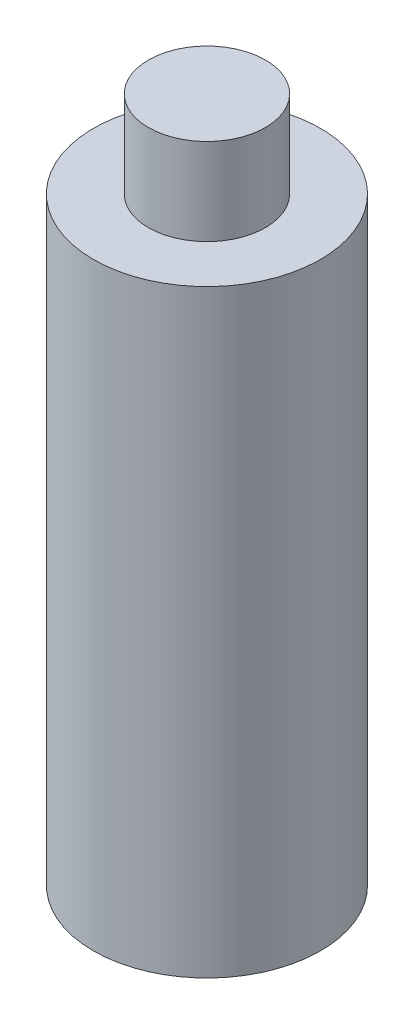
ISO-10303-21;
HEADER;
FILE_DESCRIPTION(('STEP AP214'),'2;1');
FILE_NAME('part.step','',(''),(''),'','','');
FILE_SCHEMA(('AUTOMOTIVE_DESIGN { 1 0 10303 214 1 1 1 1 }'));
ENDSEC;
DATA;
#1=APPLICATION_CONTEXT('core data for automotive mechanical design processes');
#2=APPLICATION_PROTOCOL_DEFINITION('international standard','automotive_design',2000,#1);
#3=PRODUCT_CONTEXT('',#1,'mechanical');
#4=PRODUCT('Part','Part','',(#3));
#5=PRODUCT_RELATED_PRODUCT_CATEGORY('part','',(#4));
#6=PRODUCT_DEFINITION_FORMATION('','',#4);
#7=PRODUCT_DEFINITION_CONTEXT('part definition',#1,'design');
#8=PRODUCT_DEFINITION('design','',#6,#7);
#9=PRODUCT_DEFINITION_SHAPE('','',#8);
#10=(LENGTH_UNIT() NAMED_UNIT(*) SI_UNIT(.MILLI.,.METRE.));
#11=(NAMED_UNIT(*) PLANE_ANGLE_UNIT() SI_UNIT($,.RADIAN.));
#12=(NAMED_UNIT(*) SI_UNIT($,.STERADIAN.) SOLID_ANGLE_UNIT());
#13=UNCERTAINTY_MEASURE_WITH_UNIT(LENGTH_MEASURE(1.E-05),#10,'distance_accuracy_value','');
#14=(GEOMETRIC_REPRESENTATION_CONTEXT(3) GLOBAL_UNCERTAINTY_ASSIGNED_CONTEXT((#13)) GLOBAL_UNIT_ASSIGNED_CONTEXT((#10,
#11,#12)) REPRESENTATION_CONTEXT('',''));
#15=CARTESIAN_POINT('',(0.,0.,0.));
#16=DIRECTION('',(0.,0.,1.));
#17=DIRECTION('',(1.,0.,0.));
#18=AXIS2_PLACEMENT_3D('',#15,#16,#17);
#19=CARTESIAN_POINT('',(0.,-3.75919999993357,0.));
#20=DIRECTION('',(0.,-1.,0.));
#21=DIRECTION('',(1.,0.,0.));
#22=AXIS2_PLACEMENT_3D('',#19,#20,#21);
#23=CONICAL_SURFACE('',#22,1.60019999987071,0.89993886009);
#24=CARTESIAN_POINT('',(0.,-2.4891999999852,-8.5265128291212E-11));
#25=VERTEX_POINT('',#24);
#26=VERTEX_LOOP('',#25);
#27=FACE_BOUND('',#26,.T.);
#28=CARTESIAN_POINT('',(0.,-3.7592,0.));
#29=DIRECTION('',(0.,1.,0.));
#30=DIRECTION('',(0.,0.,1.));
#31=AXIS2_PLACEMENT_3D('',#28,#29,#30);
#32=CIRCLE('',#31,1.6002);
#33=CARTESIAN_POINT('',(0.,-3.7592,1.6002));
#34=VERTEX_POINT('',#33);
#35=EDGE_CURVE('E33',#34,#34,#32,.F.);
#36=ORIENTED_EDGE('',*,*,#35,.T.);
#37=EDGE_LOOP('',(#36));
#38=FACE_BOUND('',#37,.T.);
#39=ADVANCED_FACE('F17',(#27,#38),#23,.F.);
#40=CARTESIAN_POINT('',(0.,0.,0.));
#41=DIRECTION('',(0.,1.,0.));
#42=DIRECTION('',(0.,0.,1.));
#43=AXIS2_PLACEMENT_3D('',#40,#41,#42);
#44=PLANE('',#43);
#45=CARTESIAN_POINT('',(0.,0.,0.));
#46=DIRECTION('',(0.,1.,0.));
#47=DIRECTION('',(0.,0.,1.));
#48=AXIS2_PLACEMENT_3D('',#45,#46,#47);
#49=CIRCLE('',#48,1.0795);
#50=CARTESIAN_POINT('',(0.,0.,1.0795));
#51=VERTEX_POINT('',#50);
#52=EDGE_CURVE('E20',#51,#51,#49,.F.);
#53=ORIENTED_EDGE('',*,*,#52,.F.);
#54=EDGE_LOOP('',(#53));
#55=FACE_BOUND('',#54,.T.);
#56=ADVANCED_FACE('F30',(#55),#44,.T.);
#57=CARTESIAN_POINT('',(0.,-12.6492,0.));
#58=DIRECTION('',(0.,1.,0.));
#59=DIRECTION('',(0.,0.,1.));
#60=AXIS2_PLACEMENT_3D('',#57,#58,#59);
#61=CYLINDRICAL_SURFACE('',#60,1.6002);
#62=CARTESIAN_POINT('',(0.,-12.6492,0.));
#63=DIRECTION('',(0.,1.,0.));
#64=DIRECTION('',(0.,0.,1.));
#65=AXIS2_PLACEMENT_3D('',#62,#63,#64);
#66=CIRCLE('',#65,1.6002);
#67=CARTESIAN_POINT('',(0.,-12.6492,1.6002));
#68=VERTEX_POINT('',#67);
#69=EDGE_CURVE('E37',#68,#68,#66,.F.);
#70=ORIENTED_EDGE('',*,*,#69,.T.);
#71=EDGE_LOOP('',(#70));
#72=FACE_BOUND('',#71,.T.);
#73=ORIENTED_EDGE('',*,*,#35,.F.);
#74=EDGE_LOOP('',(#73));
#75=FACE_BOUND('',#74,.T.);
#76=ADVANCED_FACE('F46',(#72,#75),#61,.F.);
#77=CARTESIAN_POINT('',(0.,-1.6002,0.));
#78=DIRECTION('',(0.,1.,0.));
#79=DIRECTION('',(0.,0.,1.));
#80=AXIS2_PLACEMENT_3D('',#77,#78,#79);
#81=CYLINDRICAL_SURFACE('',#80,1.0795);
#82=ORIENTED_EDGE('',*,*,#52,.T.);
#83=EDGE_LOOP('',(#82));
#84=FACE_BOUND('',#83,.T.);
#85=CARTESIAN_POINT('',(0.,-1.6002,0.));
#86=DIRECTION('',(0.,1.,0.));
#87=DIRECTION('',(0.,0.,1.));
#88=AXIS2_PLACEMENT_3D('',#85,#86,#87);
#89=CIRCLE('',#88,1.0795);
#90=CARTESIAN_POINT('',(0.,-1.6002,1.0795));
#91=VERTEX_POINT('',#90);
#92=EDGE_CURVE('E41',#91,#91,#89,.F.);
#93=ORIENTED_EDGE('',*,*,#92,.F.);
#94=EDGE_LOOP('',(#93));
#95=FACE_BOUND('',#94,.T.);
#96=ADVANCED_FACE('F52',(#84,#95),#81,.T.);
#97=CARTESIAN_POINT('',(0.,-12.6492,0.));
#98=DIRECTION('',(0.,1.,0.));
#99=DIRECTION('',(0.,0.,1.));
#100=AXIS2_PLACEMENT_3D('',#97,#98,#99);
#101=PLANE('',#100);
#102=ORIENTED_EDGE('',*,*,#69,.F.);
#103=EDGE_LOOP('',(#102));
#104=FACE_BOUND('',#103,.T.);
#105=CARTESIAN_POINT('',(0.,-12.6492,0.));
#106=DIRECTION('',(0.,1.,0.));
#107=DIRECTION('',(0.,0.,1.));
#108=AXIS2_PLACEMENT_3D('',#105,#106,#107);
#109=CIRCLE('',#108,2.0955);
#110=CARTESIAN_POINT('',(0.,-12.6492,2.0955));
#111=VERTEX_POINT('',#110);
#112=EDGE_CURVE('E24',#111,#111,#109,.T.);
#113=ORIENTED_EDGE('',*,*,#112,.F.);
#114=EDGE_LOOP('',(#113));
#115=FACE_BOUND('',#114,.T.);
#116=ADVANCED_FACE('F48',(#104,#115),#101,.F.);
#117=CARTESIAN_POINT('',(0.,-1.6002,0.));
#118=DIRECTION('',(0.,1.,0.));
#119=DIRECTION('',(0.,0.,1.));
#120=AXIS2_PLACEMENT_3D('',#117,#118,#119);
#121=PLANE('',#120);
#122=ORIENTED_EDGE('',*,*,#92,.T.);
#123=EDGE_LOOP('',(#122));
#124=FACE_BOUND('',#123,.T.);
#125=CARTESIAN_POINT('',(0.,-1.6002,0.));
#126=DIRECTION('',(0.,1.,0.));
#127=DIRECTION('',(0.,0.,1.));
#128=AXIS2_PLACEMENT_3D('',#125,#126,#127);
#129=CIRCLE('',#128,2.0955);
#130=CARTESIAN_POINT('',(0.,-1.6002,2.0955));
#131=VERTEX_POINT('',#130);
#132=EDGE_CURVE('E11',#131,#131,#129,.F.);
#133=ORIENTED_EDGE('',*,*,#132,.F.);
#134=EDGE_LOOP('',(#133));
#135=FACE_BOUND('',#134,.T.);
#136=ADVANCED_FACE('F51',(#124,#135),#121,.T.);
#137=CARTESIAN_POINT('',(0.,-12.6492,0.));
#138=DIRECTION('',(0.,1.,0.));
#139=DIRECTION('',(0.,0.,1.));
#140=AXIS2_PLACEMENT_3D('',#137,#138,#139);
#141=CYLINDRICAL_SURFACE('',#140,2.0955);
#142=ORIENTED_EDGE('',*,*,#132,.T.);
#143=EDGE_LOOP('',(#142));
#144=FACE_BOUND('',#143,.T.);
#145=ORIENTED_EDGE('',*,*,#112,.T.);
#146=EDGE_LOOP('',(#145));
#147=FACE_BOUND('',#146,.T.);
#148=ADVANCED_FACE('F56',(#144,#147),#141,.T.);
#149=CLOSED_SHELL('',(#39,#56,#76,#96,#116,#136,#148));
#150=MANIFOLD_SOLID_BREP('B1',#149);
#151=ADVANCED_BREP_SHAPE_REPRESENTATION('',(#18,#150),#14);
#152=SHAPE_DEFINITION_REPRESENTATION(#9,#151);
ENDSEC;
END-ISO-10303-21;
